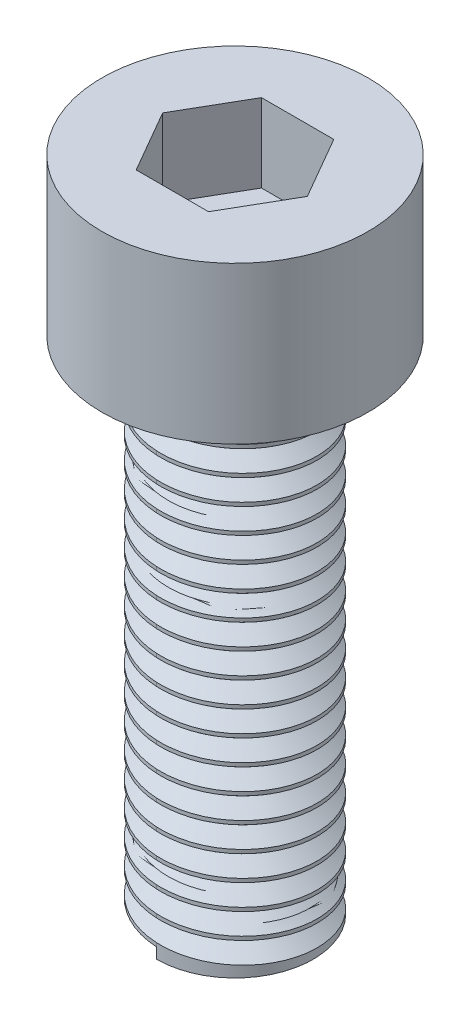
from build123d import *

# Parameters (mm, degrees)
SK_CABEZA_R         = 4.25
CABEZA_DEPTH        = 5
CANA_ROSCA_START    = -16
SK_CANA_R           = 2.5
CANA_ROSCA_DEPTH    = 16
HUECO_ALLEN_DEPTH   = 2.5
ROSCA_M5X0_8_PITCH  = 0.8
ROSCA_M5X0_8_HEIGHT = 15.4
ROSCA_M5X0_8_RADIUS = 2.5


with BuildPart() as part:
    # Sk_Cabeza → Cabeza (new body)
    with BuildSketch(Plane(origin=(0, 0, 0), x_dir=(1, 0, 0), z_dir=(0, 1, 0))):
        with Locations(Location((0, 0, 0), (0, 0, 270))):
            Circle(SK_CABEZA_R)
    extrude(amount=CABEZA_DEPTH)

    # Sk_Cana → Cana_rosca (add)
    with BuildSketch(Plane(origin=(0, 0, 0), x_dir=(1, 0, 0), z_dir=(0, 1, 0)).offset(CANA_ROSCA_START)):
        with Locations(Location((0, 0, 0), (0, 0, 270))):
            Circle(SK_CANA_R)
    extrude(amount=CANA_ROSCA_DEPTH)

    # Sk_Hueco_Allen → Hueco_Allen (cut)
    with BuildSketch(Plane(origin=(0, 5, 0), x_dir=(1, 0, 0), z_dir=(0, 1, 0))):
        Polygon((2.309401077, 0), (1.154700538, -2), (-1.154700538, -2), (-2.309401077, 0), (-1.154700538, 2), (1.154700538, 2), align=None)
    extrude(amount=-HUECO_ALLEN_DEPTH, mode=Mode.SUBTRACT)

    # Rosca_M5x0_8: sweep along a helix
    with BuildLine() as rosca_m5x0_8_path:
        Helix(ROSCA_M5X0_8_PITCH, ROSCA_M5X0_8_HEIGHT, ROSCA_M5X0_8_RADIUS, center=(0, -16, 0), direction=(0, 1, 0), lefthand=True)
    # Sk_Perfil_rosca → Rosca_M5x0_8 (sweep, cut)
    with BuildSketch(Plane(origin=(0, 0, 0), x_dir=(0, 0, -1), z_dir=(1, 0, 0))):
        Polygon((-2.7, -16.48), (-2.00928, -16), (-2.7, -15.52), align=None)
    sweep(path=rosca_m5x0_8_path.line, is_frenet=True, mode=Mode.SUBTRACT)


solid = part.part
